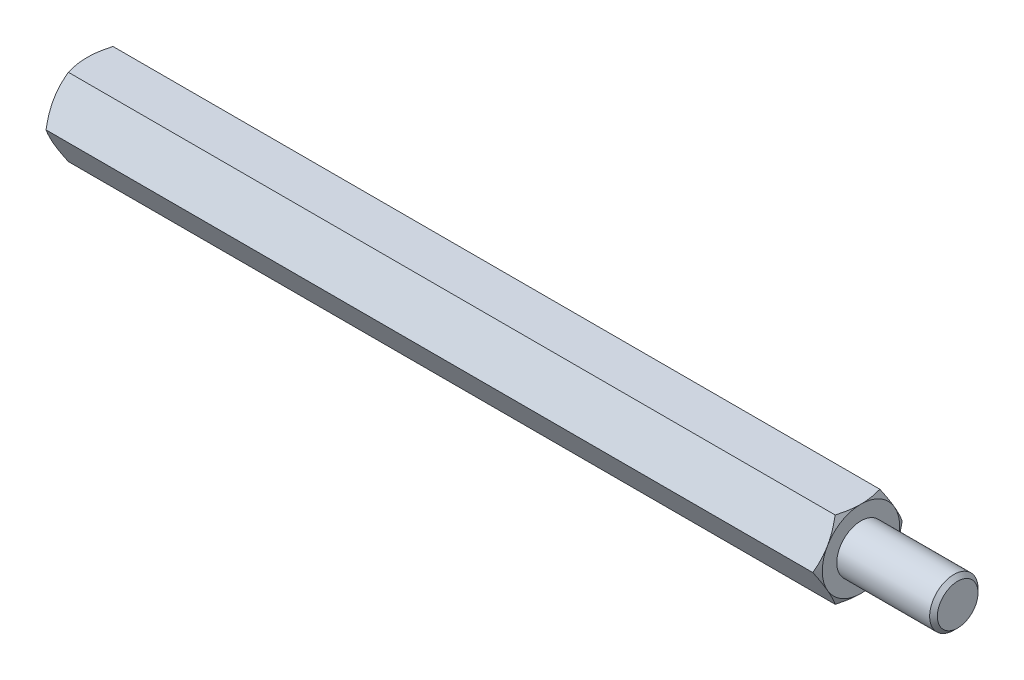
ISO-10303-21;
HEADER;
FILE_DESCRIPTION(('STEP AP214'),'2;1');
FILE_NAME('part.step','',(''),(''),'','','');
FILE_SCHEMA(('AUTOMOTIVE_DESIGN { 1 0 10303 214 1 1 1 1 }'));
ENDSEC;
DATA;
#1=APPLICATION_CONTEXT('core data for automotive mechanical design processes');
#2=APPLICATION_PROTOCOL_DEFINITION('international standard','automotive_design',2000,#1);
#3=PRODUCT_CONTEXT('',#1,'mechanical');
#4=PRODUCT('Part','Part','',(#3));
#5=PRODUCT_RELATED_PRODUCT_CATEGORY('part','',(#4));
#6=PRODUCT_DEFINITION_FORMATION('','',#4);
#7=PRODUCT_DEFINITION_CONTEXT('part definition',#1,'design');
#8=PRODUCT_DEFINITION('design','',#6,#7);
#9=PRODUCT_DEFINITION_SHAPE('','',#8);
#10=(LENGTH_UNIT() NAMED_UNIT(*) SI_UNIT(.MILLI.,.METRE.));
#11=(NAMED_UNIT(*) PLANE_ANGLE_UNIT() SI_UNIT($,.RADIAN.));
#12=(NAMED_UNIT(*) SI_UNIT($,.STERADIAN.) SOLID_ANGLE_UNIT());
#13=UNCERTAINTY_MEASURE_WITH_UNIT(LENGTH_MEASURE(1.E-05),#10,'distance_accuracy_value','');
#14=(GEOMETRIC_REPRESENTATION_CONTEXT(3) GLOBAL_UNCERTAINTY_ASSIGNED_CONTEXT((#13)) GLOBAL_UNIT_ASSIGNED_CONTEXT((#10,
#11,#12)) REPRESENTATION_CONTEXT('',''));
#15=CARTESIAN_POINT('',(0.,0.,0.));
#16=DIRECTION('',(0.,0.,1.));
#17=DIRECTION('',(1.,0.,0.));
#18=AXIS2_PLACEMENT_3D('',#15,#16,#17);
#19=CARTESIAN_POINT('',(40.,4.,-2.3094010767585));
#20=DIRECTION('',(1.,0.,0.));
#21=DIRECTION('',(0.,0.,-1.));
#22=AXIS2_PLACEMENT_3D('',#19,#20,#21);
#23=PLANE('',#22);
#24=CARTESIAN_POINT('',(40.,0.,0.));
#25=DIRECTION('',(1.,0.,0.));
#26=DIRECTION('',(0.,0.,-1.));
#27=AXIS2_PLACEMENT_3D('',#24,#25,#26);
#28=CIRCLE('',#27,4.00000000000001);
#29=CARTESIAN_POINT('',(40.,-2.00000000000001,-3.46410161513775));
#30=VERTEX_POINT('',#29);
#31=CARTESIAN_POINT('',(40.,1.99999999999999,-3.46410161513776));
#32=VERTEX_POINT('',#31);
#33=EDGE_CURVE('E288',#30,#32,#28,.T.);
#34=ORIENTED_EDGE('',*,*,#33,.T.);
#35=CARTESIAN_POINT('',(40.,4.,0.));
#36=VERTEX_POINT('',#35);
#37=EDGE_CURVE('E53',#32,#36,#28,.T.);
#38=ORIENTED_EDGE('',*,*,#37,.T.);
#39=CARTESIAN_POINT('',(40.,2.,3.46410161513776));
#40=VERTEX_POINT('',#39);
#41=EDGE_CURVE('E297',#36,#40,#28,.T.);
#42=ORIENTED_EDGE('',*,*,#41,.T.);
#43=CARTESIAN_POINT('',(40.,-2.00000000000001,3.46410161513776));
#44=VERTEX_POINT('',#43);
#45=EDGE_CURVE('E302',#40,#44,#28,.T.);
#46=ORIENTED_EDGE('',*,*,#45,.T.);
#47=CARTESIAN_POINT('',(40.,0.,0.));
#48=DIRECTION('',(-1.,0.,0.));
#49=DIRECTION('',(0.,-1.,0.));
#50=AXIS2_PLACEMENT_3D('',#47,#48,#49);
#51=CIRCLE('',#50,4.00000000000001);
#52=CARTESIAN_POINT('',(40.,-4.00000000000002,0.));
#53=VERTEX_POINT('',#52);
#54=EDGE_CURVE('E193',#53,#44,#51,.T.);
#55=ORIENTED_EDGE('',*,*,#54,.F.);
#56=EDGE_CURVE('E61',#53,#30,#28,.T.);
#57=ORIENTED_EDGE('',*,*,#56,.T.);
#58=EDGE_LOOP('',(#34,#38,#42,#46,#55,#57));
#59=FACE_BOUND('',#58,.T.);
#60=CARTESIAN_POINT('',(40.,0.,0.));
#61=DIRECTION('',(1.,0.,0.));
#62=DIRECTION('',(0.,0.,-1.));
#63=AXIS2_PLACEMENT_3D('',#60,#61,#62);
#64=CIRCLE('',#63,2.5);
#65=CARTESIAN_POINT('',(40.,0.,-2.5));
#66=VERTEX_POINT('',#65);
#67=EDGE_CURVE('E406',#66,#66,#64,.T.);
#68=ORIENTED_EDGE('',*,*,#67,.F.);
#69=EDGE_LOOP('',(#68));
#70=FACE_BOUND('',#69,.T.);
#71=ADVANCED_FACE('F37',(#59,#70),#23,.T.);
#72=CARTESIAN_POINT('',(40.,0.,-4.61880215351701));
#73=DIRECTION('',(0.,-0.5,0.866025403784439));
#74=DIRECTION('',(0.,-0.866025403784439,-0.5));
#75=AXIS2_PLACEMENT_3D('',#72,#73,#74);
#76=PLANE('',#75);
#77=CARTESIAN_POINT('',(39.6426677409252,-0.000200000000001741,-4.61891762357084));
#78=CARTESIAN_POINT('',(39.7012821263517,0.175579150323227,-4.5174314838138));
#79=CARTESIAN_POINT('',(39.7545896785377,0.35287561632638,-4.41506932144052));
#80=CARTESIAN_POINT('',(39.8476383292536,0.710538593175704,-4.20857250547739));
#81=CARTESIAN_POINT('',(39.8873465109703,0.890911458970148,-4.10443418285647));
#82=CARTESIAN_POINT('',(39.9491577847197,1.24942181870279,-3.89744813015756));
#83=CARTESIAN_POINT('',(39.9716722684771,1.42750415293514,-3.79463224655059));
#84=CARTESIAN_POINT('',(39.9985493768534,1.7845067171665,-3.58851671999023));
#85=CARTESIAN_POINT('',(40.0029342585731,1.9634256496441,-3.48521782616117));
#86=CARTESIAN_POINT('',(39.99380992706,2.29774284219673,-3.29219970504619));
#87=CARTESIAN_POINT('',(39.982541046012,2.45319115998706,-3.20245157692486));
#88=CARTESIAN_POINT('',(39.9468260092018,2.76307505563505,-3.02354002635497));
#89=CARTESIAN_POINT('',(39.9223676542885,2.91750956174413,-2.93437722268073));
#90=CARTESIAN_POINT('',(39.8612239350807,3.22803232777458,-2.75509682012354));
#91=CARTESIAN_POINT('',(39.8242793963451,3.3840812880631,-2.6650019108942));
#92=CARTESIAN_POINT('',(39.740429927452,3.69385183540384,-2.486155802));
#93=CARTESIAN_POINT('',(39.6935446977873,3.84757739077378,-2.39740231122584));
#94=CARTESIAN_POINT('',(39.6426677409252,4.0002,-2.30928560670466));
#95=B_SPLINE_CURVE_WITH_KNOTS('',3,(#77,#78,#79,#80,#81,#82,#83,#84,#85,#86,#87,#88,#89,#90,#91,
#92,#93,#94),.UNSPECIFIED.,.F.,.F.,(4,2,2,2,2,2,2,2,4),(0.,0.634047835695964,1.26961969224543,
1.88946157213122,2.50854226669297,3.04757825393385,3.58711366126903,4.13861653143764,
4.68903648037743),.UNSPECIFIED.);
#96=CARTESIAN_POINT('',(39.6427344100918,0.,-4.61880215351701));
#97=VERTEX_POINT('',#96);
#98=EDGE_CURVE('E376',#97,#32,#95,.T.);
#99=ORIENTED_EDGE('',*,*,#98,.F.);
#100=DIRECTION('',(-1.,0.,0.));
#101=VECTOR('',#100,1.);
#102=CARTESIAN_POINT('',(40.,0.,-4.61880215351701));
#103=LINE('',#102,#101);
#104=CARTESIAN_POINT('',(-39.6427344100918,0.,-4.61880215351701));
#105=VERTEX_POINT('',#104);
#106=EDGE_CURVE('E264',#97,#105,#103,.T.);
#107=ORIENTED_EDGE('',*,*,#106,.T.);
#108=CARTESIAN_POINT('',(-39.6426677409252,4.0002,-2.30928560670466));
#109=CARTESIAN_POINT('',(-39.7012821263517,3.82442084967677,-2.4107717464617));
#110=CARTESIAN_POINT('',(-39.7545896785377,3.64712438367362,-2.51313390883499));
#111=CARTESIAN_POINT('',(-39.8476383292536,3.28946140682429,-2.71963072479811));
#112=CARTESIAN_POINT('',(-39.8873465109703,3.10908854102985,-2.82376904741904));
#113=CARTESIAN_POINT('',(-39.9491577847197,2.75057818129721,-3.03075510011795));
#114=CARTESIAN_POINT('',(-39.9716722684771,2.57249584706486,-3.13357098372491));
#115=CARTESIAN_POINT('',(-39.9985493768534,2.21549328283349,-3.33968651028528));
#116=CARTESIAN_POINT('',(-40.0029342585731,2.0365743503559,-3.44298540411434));
#117=CARTESIAN_POINT('',(-39.99380992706,1.70225715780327,-3.63600352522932));
#118=CARTESIAN_POINT('',(-39.982541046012,1.54680884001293,-3.72575165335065));
#119=CARTESIAN_POINT('',(-39.9468260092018,1.23692494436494,-3.90466320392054));
#120=CARTESIAN_POINT('',(-39.9223676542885,1.08249043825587,-3.99382600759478));
#121=CARTESIAN_POINT('',(-39.8612239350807,0.771967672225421,-4.17310641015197));
#122=CARTESIAN_POINT('',(-39.8242793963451,0.615918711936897,-4.26320131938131));
#123=CARTESIAN_POINT('',(-39.740429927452,0.306148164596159,-4.4420474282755));
#124=CARTESIAN_POINT('',(-39.6935446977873,0.152422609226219,-4.53080091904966));
#125=CARTESIAN_POINT('',(-39.6426677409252,-0.000200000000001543,-4.61891762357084));
#126=B_SPLINE_CURVE_WITH_KNOTS('',3,(#108,#109,#110,#111,#112,#113,#114,#115,#116,#117,#118,
#119,#120,#121,#122,#123,#124,#125),.UNSPECIFIED.,.F.,.F.,(4,2,2,2,2,2,2,2,4),(0.,
0.634047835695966,1.26961969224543,1.88946157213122,2.50854226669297,3.04757825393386,
3.58711366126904,4.13861653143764,4.68903648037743),.UNSPECIFIED.);
#127=CARTESIAN_POINT('',(-40.,1.99999999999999,-3.46410161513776));
#128=VERTEX_POINT('',#127);
#129=EDGE_CURVE('E349',#128,#105,#126,.T.);
#130=ORIENTED_EDGE('',*,*,#129,.F.);
#131=CARTESIAN_POINT('',(-39.6427344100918,4.,-2.3094010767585));
#132=VERTEX_POINT('',#131);
#133=EDGE_CURVE('E338',#132,#128,#126,.T.);
#134=ORIENTED_EDGE('',*,*,#133,.F.);
#135=DIRECTION('',(-1.,0.,0.));
#136=VECTOR('',#135,1.);
#137=CARTESIAN_POINT('',(40.,4.,-2.3094010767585));
#138=LINE('',#137,#136);
#139=CARTESIAN_POINT('',(39.642734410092,4.,-2.30940107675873));
#140=VERTEX_POINT('',#139);
#141=EDGE_CURVE('E279',#140,#132,#138,.T.);
#142=ORIENTED_EDGE('',*,*,#141,.F.);
#143=EDGE_CURVE('E229',#32,#140,#95,.T.);
#144=ORIENTED_EDGE('',*,*,#143,.F.);
#145=EDGE_LOOP('',(#99,#107,#130,#134,#142,#144));
#146=FACE_BOUND('',#145,.T.);
#147=ADVANCED_FACE('F148',(#146),#76,.F.);
#148=CARTESIAN_POINT('',(40.,4.,-2.3094010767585));
#149=DIRECTION('',(0.,-1.,0.));
#150=DIRECTION('',(0.,0.,-1.));
#151=AXIS2_PLACEMENT_3D('',#148,#149,#150);
#152=PLANE('',#151);
#153=CARTESIAN_POINT('',(38.0082907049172,4.,-6.28479524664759));
#154=CARTESIAN_POINT('',(38.0937006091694,4.,-6.1093934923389));
#155=CARTESIAN_POINT('',(38.1783148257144,4.,-5.93359774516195));
#156=CARTESIAN_POINT('',(38.3455059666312,4.,-5.58100905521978));
#157=CARTESIAN_POINT('',(38.4280825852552,4.,-5.40421596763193));
#158=CARTESIAN_POINT('',(38.5911508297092,4.,-5.0485508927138));
#159=CARTESIAN_POINT('',(38.6716293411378,4.,-4.86967287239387));
#160=CARTESIAN_POINT('',(38.829400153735,4.,-4.51052237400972));
#161=CARTESIAN_POINT('',(38.906692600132,4.,-4.33024995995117));
#162=CARTESIAN_POINT('',(39.059802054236,4.,-3.9618911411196));
#163=CARTESIAN_POINT('',(39.135480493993,4.,-3.77374683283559));
#164=CARTESIAN_POINT('',(39.2813045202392,4.,-3.39528725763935));
#165=CARTESIAN_POINT('',(39.3514494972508,4.,-3.20497175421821));
#166=CARTESIAN_POINT('',(39.4844245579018,4.,-2.82219775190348));
#167=CARTESIAN_POINT('',(39.5472687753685,4.,-2.62974421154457));
#168=CARTESIAN_POINT('',(39.6636796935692,4.,-2.24207725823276));
#169=CARTESIAN_POINT('',(39.7172492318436,4.,-2.0468647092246));
#170=CARTESIAN_POINT('',(39.8123031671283,4.,-1.65467425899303));
#171=CARTESIAN_POINT('',(39.8538563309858,4.,-1.45771333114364));
#172=CARTESIAN_POINT('',(39.9225903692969,4.,-1.06125849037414));
#173=CARTESIAN_POINT('',(39.9497727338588,4.,-0.861764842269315));
#174=CARTESIAN_POINT('',(39.9872447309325,4.,-0.463879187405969));
#175=CARTESIAN_POINT('',(39.9977578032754,4.,-0.265508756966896));
#176=CARTESIAN_POINT('',(40.0015934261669,4.,0.131417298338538));
#177=CARTESIAN_POINT('',(39.9949158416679,4.,0.329972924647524));
#178=CARTESIAN_POINT('',(39.9696489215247,4.,0.664692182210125));
#179=CARTESIAN_POINT('',(39.9553708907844,4.,0.8012029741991));
#180=CARTESIAN_POINT('',(39.9195349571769,4.,1.07327201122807));
#181=CARTESIAN_POINT('',(39.8979761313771,4.,1.20883013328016));
#182=CARTESIAN_POINT('',(39.8235066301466,4.,1.61386939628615));
#183=CARTESIAN_POINT('',(39.7608149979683,4.,1.88157484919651));
#184=CARTESIAN_POINT('',(39.6515117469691,4.,2.28197262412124));
#185=CARTESIAN_POINT('',(39.612009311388,4.,2.41672443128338));
#186=CARTESIAN_POINT('',(39.5287523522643,4.,2.68492067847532));
#187=CARTESIAN_POINT('',(39.4849977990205,4.,2.81836510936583));
#188=CARTESIAN_POINT('',(39.3939510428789,4.,3.08398596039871));
#189=CARTESIAN_POINT('',(39.346659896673,4.,3.21616274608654));
#190=CARTESIAN_POINT('',(39.2491111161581,4.,3.47941134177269));
#191=CARTESIAN_POINT('',(39.1988535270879,4.,3.61048316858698));
#192=CARTESIAN_POINT('',(39.0713295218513,4.,3.93385125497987));
#193=CARTESIAN_POINT('',(38.9926014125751,4.,4.12557021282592));
#194=CARTESIAN_POINT('',(38.8309693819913,4.,4.50724553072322));
#195=CARTESIAN_POINT('',(38.7480651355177,4.,4.69720175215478));
#196=CARTESIAN_POINT('',(38.5789699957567,4.,5.07569950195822));
#197=CARTESIAN_POINT('',(38.4927782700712,4.,5.26424065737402));
#198=CARTESIAN_POINT('',(38.3178011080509,4.,5.64011758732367));
#199=CARTESIAN_POINT('',(38.2290156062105,4.,5.82745333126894));
#200=CARTESIAN_POINT('',(37.9593432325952,4.,6.38844423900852));
#201=CARTESIAN_POINT('',(37.7753561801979,4.,6.76060781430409));
#202=CARTESIAN_POINT('',(37.4019562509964,4.,7.50211228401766));
#203=CARTESIAN_POINT('',(37.2125442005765,4.,7.87145359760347));
#204=CARTESIAN_POINT('',(36.8473877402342,4.,8.57450173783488));
#205=CARTESIAN_POINT('',(36.671975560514,4.,8.90838144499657));
#206=CARTESIAN_POINT('',(36.3188097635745,4.,9.57491712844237));
#207=CARTESIAN_POINT('',(36.1410560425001,4.,9.90757304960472));
#208=CARTESIAN_POINT('',(35.7842933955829,4.,10.5709822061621));
#209=CARTESIAN_POINT('',(35.6052895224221,3.99999999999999,10.9017381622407));
#210=CARTESIAN_POINT('',(35.2459071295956,3.99999999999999,11.5624752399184));
#211=CARTESIAN_POINT('',(35.0655286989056,3.99999999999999,11.8924564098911));
#212=CARTESIAN_POINT('',(34.884642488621,3.99999999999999,12.2221569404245));
#213=B_SPLINE_CURVE_WITH_KNOTS('',3,(#153,#154,#155,#156,#157,#158,#159,#160,#161,#162,#163,
#164,#165,#166,#167,#168,#169,#170,#171,#172,#173,#174,#175,#176,#177,#178,#179,#180,#181,#182,
#183,#184,#185,#186,#187,#188,#189,#190,#191,#192,#193,#194,#195,#196,#197,#198,#199,#200,#201,
#202,#203,#204,#205,#206,#207,#208,#209,#210,#211,#212),.UNSPECIFIED.,.F.,.F.,(4,2,2,2,2,2,2,2,
2,2,2,2,2,2,2,2,2,2,2,2,2,2,2,2,2,2,2,2,2,4),(0.,0.585280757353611,1.17064881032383,
1.75906864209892,2.34746162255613,2.9557770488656,3.56415938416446,4.17134357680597,
4.77834167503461,5.38179402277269,5.98518378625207,6.5804150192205,7.17565092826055,
7.58721910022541,7.99883946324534,8.82250155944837,9.24373134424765,9.66496407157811,
10.086071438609,10.5071723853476,11.1288656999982,11.7506074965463,12.3725077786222,
12.9944237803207,14.2398211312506,15.4850297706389,16.6164791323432,17.7479788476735,
18.8762380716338,20.0044248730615),.UNSPECIFIED.);
#214=EDGE_CURVE('E227',#140,#36,#213,.T.);
#215=ORIENTED_EDGE('',*,*,#214,.F.);
#216=ORIENTED_EDGE('',*,*,#141,.T.);
#217=CARTESIAN_POINT('',(-38.0082907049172,4.,-6.28479524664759));
#218=CARTESIAN_POINT('',(-38.0937006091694,4.,-6.1093934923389));
#219=CARTESIAN_POINT('',(-38.1783148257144,4.,-5.93359774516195));
#220=CARTESIAN_POINT('',(-38.3455059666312,4.,-5.58100905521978));
#221=CARTESIAN_POINT('',(-38.4280825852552,4.,-5.40421596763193));
#222=CARTESIAN_POINT('',(-38.5911508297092,4.,-5.0485508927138));
#223=CARTESIAN_POINT('',(-38.6716293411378,4.,-4.86967287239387));
#224=CARTESIAN_POINT('',(-38.829400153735,4.,-4.51052237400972));
#225=CARTESIAN_POINT('',(-38.906692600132,4.,-4.33024995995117));
#226=CARTESIAN_POINT('',(-39.059802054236,4.,-3.9618911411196));
#227=CARTESIAN_POINT('',(-39.135480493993,4.,-3.77374683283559));
#228=CARTESIAN_POINT('',(-39.2813045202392,4.,-3.39528725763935));
#229=CARTESIAN_POINT('',(-39.3514494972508,4.,-3.20497175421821));
#230=CARTESIAN_POINT('',(-39.4844245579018,4.,-2.82219775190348));
#231=CARTESIAN_POINT('',(-39.5472687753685,4.,-2.62974421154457));
#232=CARTESIAN_POINT('',(-39.6636796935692,4.,-2.24207725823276));
#233=CARTESIAN_POINT('',(-39.7172492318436,4.,-2.0468647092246));
#234=CARTESIAN_POINT('',(-39.8123031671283,4.,-1.65467425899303));
#235=CARTESIAN_POINT('',(-39.8538563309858,4.,-1.45771333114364));
#236=CARTESIAN_POINT('',(-39.9225903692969,4.,-1.06125849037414));
#237=CARTESIAN_POINT('',(-39.9497727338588,4.,-0.861764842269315));
#238=CARTESIAN_POINT('',(-39.9872447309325,4.,-0.463879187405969));
#239=CARTESIAN_POINT('',(-39.9977578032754,4.,-0.265508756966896));
#240=CARTESIAN_POINT('',(-40.0015934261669,4.,0.131417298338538));
#241=CARTESIAN_POINT('',(-39.9949158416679,4.,0.329972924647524));
#242=CARTESIAN_POINT('',(-39.9696489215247,4.,0.664692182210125));
#243=CARTESIAN_POINT('',(-39.9553708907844,4.,0.8012029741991));
#244=CARTESIAN_POINT('',(-39.9195349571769,4.,1.07327201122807));
#245=CARTESIAN_POINT('',(-39.8979761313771,4.,1.20883013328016));
#246=CARTESIAN_POINT('',(-39.8235066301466,4.,1.61386939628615));
#247=CARTESIAN_POINT('',(-39.7608149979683,4.,1.88157484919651));
#248=CARTESIAN_POINT('',(-39.6515117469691,4.,2.28197262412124));
#249=CARTESIAN_POINT('',(-39.612009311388,4.,2.41672443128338));
#250=CARTESIAN_POINT('',(-39.5287523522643,4.,2.68492067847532));
#251=CARTESIAN_POINT('',(-39.4849977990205,4.,2.81836510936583));
#252=CARTESIAN_POINT('',(-39.3939510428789,4.,3.08398596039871));
#253=CARTESIAN_POINT('',(-39.346659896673,4.,3.21616274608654));
#254=CARTESIAN_POINT('',(-39.2491111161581,4.,3.47941134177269));
#255=CARTESIAN_POINT('',(-39.1988535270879,4.,3.61048316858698));
#256=CARTESIAN_POINT('',(-39.0713295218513,4.,3.93385125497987));
#257=CARTESIAN_POINT('',(-38.9926014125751,4.,4.12557021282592));
#258=CARTESIAN_POINT('',(-38.8309693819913,4.,4.50724553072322));
#259=CARTESIAN_POINT('',(-38.7480651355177,4.,4.69720175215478));
#260=CARTESIAN_POINT('',(-38.5789699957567,4.,5.07569950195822));
#261=CARTESIAN_POINT('',(-38.4927782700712,4.,5.26424065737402));
#262=CARTESIAN_POINT('',(-38.3178011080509,4.,5.64011758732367));
#263=CARTESIAN_POINT('',(-38.2290156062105,4.,5.82745333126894));
#264=CARTESIAN_POINT('',(-37.9593432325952,4.,6.38844423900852));
#265=CARTESIAN_POINT('',(-37.7753561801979,4.,6.76060781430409));
#266=CARTESIAN_POINT('',(-37.4019562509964,4.,7.50211228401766));
#267=CARTESIAN_POINT('',(-37.2125442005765,4.,7.87145359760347));
#268=CARTESIAN_POINT('',(-36.8473877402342,4.,8.57450173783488));
#269=CARTESIAN_POINT('',(-36.671975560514,4.,8.90838144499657));
#270=CARTESIAN_POINT('',(-36.3188097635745,4.,9.57491712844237));
#271=CARTESIAN_POINT('',(-36.1410560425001,4.,9.90757304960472));
#272=CARTESIAN_POINT('',(-35.7842933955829,4.,10.5709822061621));
#273=CARTESIAN_POINT('',(-35.6052895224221,3.99999999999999,10.9017381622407));
#274=CARTESIAN_POINT('',(-35.2459071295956,3.99999999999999,11.5624752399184));
#275=CARTESIAN_POINT('',(-35.0655286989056,3.99999999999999,11.8924564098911));
#276=CARTESIAN_POINT('',(-34.884642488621,3.99999999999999,12.2221569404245));
#277=B_SPLINE_CURVE_WITH_KNOTS('',3,(#217,#218,#219,#220,#221,#222,#223,#224,#225,#226,#227,
#228,#229,#230,#231,#232,#233,#234,#235,#236,#237,#238,#239,#240,#241,#242,#243,#244,#245,#246,
#247,#248,#249,#250,#251,#252,#253,#254,#255,#256,#257,#258,#259,#260,#261,#262,#263,#264,#265,
#266,#267,#268,#269,#270,#271,#272,#273,#274,#275,#276),.UNSPECIFIED.,.F.,.F.,(4,2,2,2,2,2,2,2,
2,2,2,2,2,2,2,2,2,2,2,2,2,2,2,2,2,2,2,2,2,4),(0.,0.585280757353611,1.17064881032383,
1.75906864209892,2.34746162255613,2.9557770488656,3.56415938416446,4.17134357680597,
4.77834167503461,5.38179402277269,5.98518378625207,6.5804150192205,7.17565092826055,
7.58721910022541,7.99883946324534,8.82250155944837,9.24373134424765,9.66496407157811,
10.086071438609,10.5071723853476,11.1288656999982,11.7506074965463,12.3725077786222,
12.9944237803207,14.2398211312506,15.4850297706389,16.6164791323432,17.7479788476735,
18.8762380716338,20.0044248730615),.UNSPECIFIED.);
#278=CARTESIAN_POINT('',(-40.,4.,0.));
#279=VERTEX_POINT('',#278);
#280=EDGE_CURVE('E241',#279,#132,#277,.F.);
#281=ORIENTED_EDGE('',*,*,#280,.F.);
#282=CARTESIAN_POINT('',(-39.6427344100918,4.,2.3094010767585));
#283=VERTEX_POINT('',#282);
#284=EDGE_CURVE('E249',#283,#279,#277,.F.);
#285=ORIENTED_EDGE('',*,*,#284,.F.);
#286=DIRECTION('',(-1.,0.,0.));
#287=VECTOR('',#286,1.);
#288=CARTESIAN_POINT('',(40.,4.,2.3094010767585));
#289=LINE('',#288,#287);
#290=CARTESIAN_POINT('',(39.6427344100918,4.,2.3094010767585));
#291=VERTEX_POINT('',#290);
#292=EDGE_CURVE('E276',#291,#283,#289,.T.);
#293=ORIENTED_EDGE('',*,*,#292,.F.);
#294=EDGE_CURVE('E221',#36,#291,#213,.T.);
#295=ORIENTED_EDGE('',*,*,#294,.F.);
#296=EDGE_LOOP('',(#215,#216,#281,#285,#293,#295));
#297=FACE_BOUND('',#296,.T.);
#298=ADVANCED_FACE('F153',(#297),#152,.F.);
#299=CARTESIAN_POINT('',(40.,4.,2.3094010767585));
#300=DIRECTION('',(0.,-0.5,-0.866025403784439));
#301=DIRECTION('',(0.,0.866025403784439,-0.5));
#302=AXIS2_PLACEMENT_3D('',#299,#300,#301);
#303=PLANE('',#302);
#304=CARTESIAN_POINT('',(39.6426677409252,4.0002,2.30928560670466));
#305=CARTESIAN_POINT('',(39.7012821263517,3.82442084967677,2.4107717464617));
#306=CARTESIAN_POINT('',(39.7545896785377,3.64712438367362,2.51313390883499));
#307=CARTESIAN_POINT('',(39.8476383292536,3.28946140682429,2.71963072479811));
#308=CARTESIAN_POINT('',(39.8873465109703,3.10908854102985,2.82376904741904));
#309=CARTESIAN_POINT('',(39.9491577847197,2.75057818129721,3.03075510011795));
#310=CARTESIAN_POINT('',(39.9716722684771,2.57249584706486,3.13357098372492));
#311=CARTESIAN_POINT('',(39.9985493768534,2.21549328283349,3.33968651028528));
#312=CARTESIAN_POINT('',(40.0029342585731,2.0365743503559,3.44298540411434));
#313=CARTESIAN_POINT('',(39.99380992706,1.70225715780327,3.63600352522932));
#314=CARTESIAN_POINT('',(39.982541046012,1.54680884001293,3.72575165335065));
#315=CARTESIAN_POINT('',(39.9468260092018,1.23692494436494,3.90466320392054));
#316=CARTESIAN_POINT('',(39.9223676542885,1.08249043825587,3.99382600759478));
#317=CARTESIAN_POINT('',(39.8612239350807,0.771967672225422,4.17310641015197));
#318=CARTESIAN_POINT('',(39.8242793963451,0.615918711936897,4.26320131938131));
#319=CARTESIAN_POINT('',(39.740429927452,0.30614816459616,4.4420474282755));
#320=CARTESIAN_POINT('',(39.6935446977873,0.152422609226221,4.53080091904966));
#321=CARTESIAN_POINT('',(39.6426677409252,-0.000199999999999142,4.61891762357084));
#322=B_SPLINE_CURVE_WITH_KNOTS('',3,(#304,#305,#306,#307,#308,#309,#310,#311,#312,#313,#314,
#315,#316,#317,#318,#319,#320,#321),.UNSPECIFIED.,.F.,.F.,(4,2,2,2,2,2,2,2,4),(0.,
0.634047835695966,1.26961969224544,1.88946157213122,2.50854226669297,3.04757825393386,
3.58711366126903,4.13861653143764,4.68903648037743),.UNSPECIFIED.);
#323=EDGE_CURVE('E228',#291,#40,#322,.T.);
#324=ORIENTED_EDGE('',*,*,#323,.F.);
#325=ORIENTED_EDGE('',*,*,#292,.T.);
#326=CARTESIAN_POINT('',(-39.6426677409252,-0.000199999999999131,4.61891762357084));
#327=CARTESIAN_POINT('',(-39.7012821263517,0.17557915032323,4.5174314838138));
#328=CARTESIAN_POINT('',(-39.7545896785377,0.352875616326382,4.41506932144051));
#329=CARTESIAN_POINT('',(-39.8476383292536,0.710538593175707,4.20857250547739));
#330=CARTESIAN_POINT('',(-39.8873465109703,0.890911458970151,4.10443418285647));
#331=CARTESIAN_POINT('',(-39.9491577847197,1.24942181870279,3.89744813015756));
#332=CARTESIAN_POINT('',(-39.9716722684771,1.42750415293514,3.79463224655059));
#333=CARTESIAN_POINT('',(-39.9985493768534,1.78450671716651,3.58851671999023));
#334=CARTESIAN_POINT('',(-40.0029342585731,1.9634256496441,3.48521782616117));
#335=CARTESIAN_POINT('',(-39.99380992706,2.29774284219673,3.29219970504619));
#336=CARTESIAN_POINT('',(-39.982541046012,2.45319115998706,3.20245157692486));
#337=CARTESIAN_POINT('',(-39.9468260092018,2.76307505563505,3.02354002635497));
#338=CARTESIAN_POINT('',(-39.9223676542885,2.91750956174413,2.93437722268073));
#339=CARTESIAN_POINT('',(-39.8612239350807,3.22803232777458,2.75509682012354));
#340=CARTESIAN_POINT('',(-39.8242793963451,3.3840812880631,2.6650019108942));
#341=CARTESIAN_POINT('',(-39.740429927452,3.69385183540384,2.48615580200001));
#342=CARTESIAN_POINT('',(-39.6935446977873,3.84757739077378,2.39740231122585));
#343=CARTESIAN_POINT('',(-39.6426677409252,4.0002,2.30928560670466));
#344=B_SPLINE_CURVE_WITH_KNOTS('',3,(#326,#327,#328,#329,#330,#331,#332,#333,#334,#335,#336,
#337,#338,#339,#340,#341,#342,#343),.UNSPECIFIED.,.F.,.F.,(4,2,2,2,2,2,2,2,4),(0.,
0.634047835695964,1.26961969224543,1.88946157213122,2.50854226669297,3.04757825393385,
3.58711366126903,4.13861653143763,4.68903648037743),.UNSPECIFIED.);
#345=CARTESIAN_POINT('',(-40.,2.,3.46410161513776));
#346=VERTEX_POINT('',#345);
#347=EDGE_CURVE('E255',#346,#283,#344,.T.);
#348=ORIENTED_EDGE('',*,*,#347,.F.);
#349=CARTESIAN_POINT('',(-39.6427344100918,0.,4.618802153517));
#350=VERTEX_POINT('',#349);
#351=EDGE_CURVE('E262',#350,#346,#344,.T.);
#352=ORIENTED_EDGE('',*,*,#351,.F.);
#353=DIRECTION('',(-1.,0.,0.));
#354=VECTOR('',#353,1.);
#355=CARTESIAN_POINT('',(40.,0.,4.618802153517));
#356=LINE('',#355,#354);
#357=CARTESIAN_POINT('',(39.6427344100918,0.,4.618802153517));
#358=VERTEX_POINT('',#357);
#359=EDGE_CURVE('E273',#358,#350,#356,.T.);
#360=ORIENTED_EDGE('',*,*,#359,.F.);
#361=EDGE_CURVE('E215',#40,#358,#322,.T.);
#362=ORIENTED_EDGE('',*,*,#361,.F.);
#363=EDGE_LOOP('',(#324,#325,#348,#352,#360,#362));
#364=FACE_BOUND('',#363,.T.);
#365=ADVANCED_FACE('F235',(#364),#303,.F.);
#366=CARTESIAN_POINT('',(40.,0.,4.618802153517));
#367=DIRECTION('',(0.,0.5,-0.866025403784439));
#368=DIRECTION('',(0.,0.866025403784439,0.5));
#369=AXIS2_PLACEMENT_3D('',#366,#367,#368);
#370=PLANE('',#369);
#371=CARTESIAN_POINT('',(39.6426677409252,0.000200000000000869,4.61891762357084));
#372=CARTESIAN_POINT('',(39.7012821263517,-0.175579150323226,4.5174314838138));
#373=CARTESIAN_POINT('',(39.7545896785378,-0.352875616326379,4.41506932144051));
#374=CARTESIAN_POINT('',(39.8476383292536,-0.710538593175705,4.20857250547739));
#375=CARTESIAN_POINT('',(39.8873465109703,-0.890911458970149,4.10443418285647));
#376=CARTESIAN_POINT('',(39.9491577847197,-1.24942181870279,3.89744813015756));
#377=CARTESIAN_POINT('',(39.9716722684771,-1.42750415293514,3.79463224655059));
#378=CARTESIAN_POINT('',(39.9985493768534,-1.78450671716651,3.58851671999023));
#379=CARTESIAN_POINT('',(40.0029342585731,-1.9634256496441,3.48521782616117));
#380=CARTESIAN_POINT('',(39.99380992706,-2.29774284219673,3.29219970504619));
#381=CARTESIAN_POINT('',(39.982541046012,-2.45319115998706,3.20245157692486));
#382=CARTESIAN_POINT('',(39.9468260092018,-2.76307505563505,3.02354002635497));
#383=CARTESIAN_POINT('',(39.9223676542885,-2.91750956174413,2.93437722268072));
#384=CARTESIAN_POINT('',(39.8612239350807,-3.22803232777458,2.75509682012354));
#385=CARTESIAN_POINT('',(39.8242793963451,-3.3840812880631,2.6650019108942));
#386=CARTESIAN_POINT('',(39.740429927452,-3.69385183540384,2.48615580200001));
#387=CARTESIAN_POINT('',(39.6935446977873,-3.84757739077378,2.39740231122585));
#388=CARTESIAN_POINT('',(39.6426677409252,-4.0002,2.30928560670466));
#389=B_SPLINE_CURVE_WITH_KNOTS('',3,(#371,#372,#373,#374,#375,#376,#377,#378,#379,#380,#381,
#382,#383,#384,#385,#386,#387,#388),.UNSPECIFIED.,.F.,.F.,(4,2,2,2,2,2,2,2,4),(0.,
0.634047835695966,1.26961969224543,1.88946157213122,2.50854226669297,3.04757825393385,
3.58711366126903,4.13861653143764,4.68903648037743),.UNSPECIFIED.);
#390=EDGE_CURVE('E389',#358,#44,#389,.T.);
#391=ORIENTED_EDGE('',*,*,#390,.F.);
#392=ORIENTED_EDGE('',*,*,#359,.T.);
#393=CARTESIAN_POINT('',(-39.6426677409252,-4.0002,2.30928560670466));
#394=CARTESIAN_POINT('',(-39.7012821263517,-3.82442084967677,2.4107717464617));
#395=CARTESIAN_POINT('',(-39.7545896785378,-3.64712438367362,2.51313390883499));
#396=CARTESIAN_POINT('',(-39.8476383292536,-3.2894614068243,2.71963072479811));
#397=CARTESIAN_POINT('',(-39.8873465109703,-3.10908854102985,2.82376904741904));
#398=CARTESIAN_POINT('',(-39.9491577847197,-2.75057818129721,3.03075510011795));
#399=CARTESIAN_POINT('',(-39.9716722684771,-2.57249584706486,3.13357098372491));
#400=CARTESIAN_POINT('',(-39.9985493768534,-2.2154932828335,3.33968651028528));
#401=CARTESIAN_POINT('',(-40.0029342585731,-2.03657435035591,3.44298540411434));
#402=CARTESIAN_POINT('',(-39.99380992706,-1.70225715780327,3.63600352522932));
#403=CARTESIAN_POINT('',(-39.982541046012,-1.54680884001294,3.72575165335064));
#404=CARTESIAN_POINT('',(-39.9468260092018,-1.23692494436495,3.90466320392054));
#405=CARTESIAN_POINT('',(-39.9223676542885,-1.08249043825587,3.99382600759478));
#406=CARTESIAN_POINT('',(-39.8612239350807,-0.771967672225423,4.17310641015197));
#407=CARTESIAN_POINT('',(-39.8242793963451,-0.615918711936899,4.26320131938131));
#408=CARTESIAN_POINT('',(-39.740429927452,-0.306148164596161,4.4420474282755));
#409=CARTESIAN_POINT('',(-39.6935446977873,-0.152422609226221,4.53080091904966));
#410=CARTESIAN_POINT('',(-39.6426677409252,0.000200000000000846,4.61891762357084));
#411=B_SPLINE_CURVE_WITH_KNOTS('',3,(#393,#394,#395,#396,#397,#398,#399,#400,#401,#402,#403,
#404,#405,#406,#407,#408,#409,#410),.UNSPECIFIED.,.F.,.F.,(4,2,2,2,2,2,2,2,4),(0.,
0.634047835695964,1.26961969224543,1.88946157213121,2.50854226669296,3.04757825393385,
3.58711366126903,4.13861653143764,4.68903648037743),.UNSPECIFIED.);
#412=CARTESIAN_POINT('',(-40.,-2.00000000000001,3.46410161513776));
#413=VERTEX_POINT('',#412);
#414=EDGE_CURVE('E263',#413,#350,#411,.T.);
#415=ORIENTED_EDGE('',*,*,#414,.F.);
#416=CARTESIAN_POINT('',(-39.6427344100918,-4.,2.3094010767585));
#417=VERTEX_POINT('',#416);
#418=EDGE_CURVE('E250',#417,#413,#411,.T.);
#419=ORIENTED_EDGE('',*,*,#418,.F.);
#420=DIRECTION('',(-1.,0.,0.));
#421=VECTOR('',#420,1.);
#422=CARTESIAN_POINT('',(40.,-4.,2.3094010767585));
#423=LINE('',#422,#421);
#424=CARTESIAN_POINT('',(39.6427344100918,-4.,2.3094010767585));
#425=VERTEX_POINT('',#424);
#426=EDGE_CURVE('E270',#425,#417,#423,.T.);
#427=ORIENTED_EDGE('',*,*,#426,.F.);
#428=EDGE_CURVE('E210',#44,#425,#389,.T.);
#429=ORIENTED_EDGE('',*,*,#428,.F.);
#430=EDGE_LOOP('',(#391,#392,#415,#419,#427,#429));
#431=FACE_BOUND('',#430,.T.);
#432=ADVANCED_FACE('F425',(#431),#370,.F.);
#433=CARTESIAN_POINT('',(40.,-4.,2.3094010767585));
#434=DIRECTION('',(0.,1.,0.));
#435=DIRECTION('',(0.,0.,1.));
#436=AXIS2_PLACEMENT_3D('',#433,#434,#435);
#437=PLANE('',#436);
#438=CARTESIAN_POINT('',(38.0082907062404,-4.,-6.28479524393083));
#439=CARTESIAN_POINT('',(38.0937006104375,-4.,-6.10939348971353));
#440=CARTESIAN_POINT('',(38.1783148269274,-4.,-5.93359774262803));
#441=CARTESIAN_POINT('',(38.3455059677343,-4.,-5.58100905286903));
#442=CARTESIAN_POINT('',(38.4280825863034,-4.,-5.40421596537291));
#443=CARTESIAN_POINT('',(38.5911508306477,-4.,-5.04855089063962));
#444=CARTESIAN_POINT('',(38.6716293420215,-4.,-4.86967287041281));
#445=CARTESIAN_POINT('',(38.8294001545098,-4.,-4.51052237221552));
#446=CARTESIAN_POINT('',(38.9066926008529,-4.,-4.33024995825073));
#447=CARTESIAN_POINT('',(39.0598020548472,-4.,-3.96189113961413));
#448=CARTESIAN_POINT('',(39.1354804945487,-4.,-3.77374683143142));
#449=CARTESIAN_POINT('',(39.2813045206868,-4.,-3.39528725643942));
#450=CARTESIAN_POINT('',(39.3514494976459,-4.,-3.2049717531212));
#451=CARTESIAN_POINT('',(39.4844245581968,-4.,-2.82219775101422));
#452=CARTESIAN_POINT('',(39.5472687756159,-4.,-2.62974421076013));
#453=CARTESIAN_POINT('',(39.6636796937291,-4.,-2.24207725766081));
#454=CARTESIAN_POINT('',(39.7172492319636,-4.,-2.04686470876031));
#455=CARTESIAN_POINT('',(39.8123031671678,-4.,-1.65467425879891));
#456=CARTESIAN_POINT('',(39.8538563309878,-4.,-1.45771333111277));
#457=CARTESIAN_POINT('',(39.9225903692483,-4.,-1.06125849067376));
#458=CARTESIAN_POINT('',(39.9497727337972,-4.,-0.86176484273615));
#459=CARTESIAN_POINT('',(39.9872447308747,-4.,-0.463879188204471));
#460=CARTESIAN_POINT('',(39.9977578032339,-4.,-0.265508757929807));
#461=CARTESIAN_POINT('',(40.0015934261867,-4.,0.131417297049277));
#462=CARTESIAN_POINT('',(39.9949158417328,-4.,0.329972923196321));
#463=CARTESIAN_POINT('',(39.9696489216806,-4.,0.664692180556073));
#464=CARTESIAN_POINT('',(39.9553708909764,-4.,0.801202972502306));
#465=CARTESIAN_POINT('',(39.9195349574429,-4.,1.07327200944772));
#466=CARTESIAN_POINT('',(39.8979761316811,-4.,1.20883013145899));
#467=CARTESIAN_POINT('',(39.8235066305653,-4.,1.6138693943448));
#468=CARTESIAN_POINT('',(39.7608149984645,-4.,1.88157484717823));
#469=CARTESIAN_POINT('',(39.6515117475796,-4.,2.28197262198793));
#470=CARTESIAN_POINT('',(39.6120093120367,-4.,2.41672442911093));
#471=CARTESIAN_POINT('',(39.5287523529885,-4.,2.68492067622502));
#472=CARTESIAN_POINT('',(39.4849977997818,-4.,2.81836510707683));
#473=CARTESIAN_POINT('',(39.3939510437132,-4.,3.0839859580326));
#474=CARTESIAN_POINT('',(39.3466598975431,-4.,3.21616274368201));
#475=CARTESIAN_POINT('',(39.2491111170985,-4.,3.47941133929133));
#476=CARTESIAN_POINT('',(39.1988535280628,-4.,3.61048316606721));
#477=CARTESIAN_POINT('',(39.0713295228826,-4.,3.93385125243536));
#478=CARTESIAN_POINT('',(38.9926014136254,-4.,4.12557021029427));
#479=CARTESIAN_POINT('',(38.830969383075,-4.,4.50724552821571));
#480=CARTESIAN_POINT('',(38.7480651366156,-4.,4.69720174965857));
#481=CARTESIAN_POINT('',(38.5789699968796,-4.,5.07569949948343));
#482=CARTESIAN_POINT('',(38.4927782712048,-4.,5.26424065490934));
#483=CARTESIAN_POINT('',(38.3178011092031,-4.,5.64011758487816));
#484=CARTESIAN_POINT('',(38.2290156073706,-4.,5.82745332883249));
#485=CARTESIAN_POINT('',(37.9593432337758,-4.,6.38844423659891));
#486=CARTESIAN_POINT('',(37.775356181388,-4.,6.76060781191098));
#487=CARTESIAN_POINT('',(37.4019562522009,-4.,7.50211228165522));
#488=CARTESIAN_POINT('',(37.2125442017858,-4.,7.87145359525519));
#489=CARTESIAN_POINT('',(36.8473877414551,-4.,8.57450173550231));
#490=CARTESIAN_POINT('',(36.671975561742,-4.,8.90838144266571));
#491=CARTESIAN_POINT('',(36.3188097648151,-4.,9.5749171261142));
#492=CARTESIAN_POINT('',(36.1410560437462,-4.,9.90757304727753));
#493=CARTESIAN_POINT('',(35.78429339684,-4.,10.5709822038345));
#494=CARTESIAN_POINT('',(35.6052895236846,-4.,10.9017381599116));
#495=CARTESIAN_POINT('',(35.2459071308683,-4.,11.562475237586));
#496=CARTESIAN_POINT('',(35.065528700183,-4.,11.8924564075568));
#497=CARTESIAN_POINT('',(34.884642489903,-4.,12.2221569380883));
#498=B_SPLINE_CURVE_WITH_KNOTS('',3,(#438,#439,#440,#441,#442,#443,#444,#445,#446,#447,#448,
#449,#450,#451,#452,#453,#454,#455,#456,#457,#458,#459,#460,#461,#462,#463,#464,#465,#466,#467,
#468,#469,#470,#471,#472,#473,#474,#475,#476,#477,#478,#479,#480,#481,#482,#483,#484,#485,#486,
#487,#488,#489,#490,#491,#492,#493,#494,#495,#496,#497),.UNSPECIFIED.,.F.,.F.,(4,2,2,2,2,2,2,2,
2,2,2,2,2,2,2,2,2,2,2,2,2,2,2,2,2,2,2,2,2,4),(0.,0.585280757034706,1.17064880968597,
1.75906864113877,2.34746162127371,2.95577704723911,3.56415938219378,4.17134357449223,
4.77834167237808,5.38179401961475,5.98518378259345,6.58041501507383,7.17565092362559,
7.58721909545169,7.99883945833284,8.82250155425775,9.24373133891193,9.6649640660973,
10.0860714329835,10.5071723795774,11.1288656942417,11.7506074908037,12.3725077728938,
12.9944237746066,14.2398211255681,15.4850297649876,16.6164791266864,17.7479788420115,
18.8762380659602,20.0044248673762),.UNSPECIFIED.);
#499=EDGE_CURVE('E396',#425,#53,#498,.F.);
#500=ORIENTED_EDGE('',*,*,#499,.F.);
#501=ORIENTED_EDGE('',*,*,#426,.T.);
#502=CARTESIAN_POINT('',(-38.0082907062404,-4.,-6.28479524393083));
#503=CARTESIAN_POINT('',(-38.0937006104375,-4.,-6.10939348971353));
#504=CARTESIAN_POINT('',(-38.1783148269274,-4.,-5.93359774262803));
#505=CARTESIAN_POINT('',(-38.3455059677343,-4.,-5.58100905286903));
#506=CARTESIAN_POINT('',(-38.4280825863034,-4.,-5.40421596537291));
#507=CARTESIAN_POINT('',(-38.5911508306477,-4.,-5.04855089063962));
#508=CARTESIAN_POINT('',(-38.6716293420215,-4.,-4.86967287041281));
#509=CARTESIAN_POINT('',(-38.8294001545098,-4.,-4.51052237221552));
#510=CARTESIAN_POINT('',(-38.9066926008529,-4.,-4.33024995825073));
#511=CARTESIAN_POINT('',(-39.0598020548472,-4.,-3.96189113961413));
#512=CARTESIAN_POINT('',(-39.1354804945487,-4.,-3.77374683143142));
#513=CARTESIAN_POINT('',(-39.2813045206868,-4.,-3.39528725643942));
#514=CARTESIAN_POINT('',(-39.3514494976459,-4.,-3.2049717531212));
#515=CARTESIAN_POINT('',(-39.4844245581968,-4.,-2.82219775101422));
#516=CARTESIAN_POINT('',(-39.5472687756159,-4.,-2.62974421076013));
#517=CARTESIAN_POINT('',(-39.6636796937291,-4.,-2.24207725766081));
#518=CARTESIAN_POINT('',(-39.7172492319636,-4.,-2.04686470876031));
#519=CARTESIAN_POINT('',(-39.8123031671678,-4.,-1.65467425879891));
#520=CARTESIAN_POINT('',(-39.8538563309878,-4.,-1.45771333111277));
#521=CARTESIAN_POINT('',(-39.9225903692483,-4.,-1.06125849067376));
#522=CARTESIAN_POINT('',(-39.9497727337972,-4.,-0.86176484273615));
#523=CARTESIAN_POINT('',(-39.9872447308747,-4.,-0.463879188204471));
#524=CARTESIAN_POINT('',(-39.9977578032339,-4.,-0.265508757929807));
#525=CARTESIAN_POINT('',(-40.0015934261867,-4.,0.131417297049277));
#526=CARTESIAN_POINT('',(-39.9949158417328,-4.,0.329972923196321));
#527=CARTESIAN_POINT('',(-39.9696489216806,-4.,0.664692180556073));
#528=CARTESIAN_POINT('',(-39.9553708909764,-4.,0.801202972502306));
#529=CARTESIAN_POINT('',(-39.9195349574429,-4.,1.07327200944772));
#530=CARTESIAN_POINT('',(-39.8979761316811,-4.,1.20883013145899));
#531=CARTESIAN_POINT('',(-39.8235066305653,-4.,1.6138693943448));
#532=CARTESIAN_POINT('',(-39.7608149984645,-4.,1.88157484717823));
#533=CARTESIAN_POINT('',(-39.6515117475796,-4.,2.28197262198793));
#534=CARTESIAN_POINT('',(-39.6120093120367,-4.,2.41672442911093));
#535=CARTESIAN_POINT('',(-39.5287523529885,-4.,2.68492067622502));
#536=CARTESIAN_POINT('',(-39.4849977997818,-4.,2.81836510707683));
#537=CARTESIAN_POINT('',(-39.3939510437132,-4.,3.0839859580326));
#538=CARTESIAN_POINT('',(-39.3466598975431,-4.,3.21616274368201));
#539=CARTESIAN_POINT('',(-39.2491111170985,-4.,3.47941133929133));
#540=CARTESIAN_POINT('',(-39.1988535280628,-4.,3.61048316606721));
#541=CARTESIAN_POINT('',(-39.0713295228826,-4.,3.93385125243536));
#542=CARTESIAN_POINT('',(-38.9926014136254,-4.,4.12557021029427));
#543=CARTESIAN_POINT('',(-38.830969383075,-4.,4.50724552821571));
#544=CARTESIAN_POINT('',(-38.7480651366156,-4.,4.69720174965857));
#545=CARTESIAN_POINT('',(-38.5789699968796,-4.,5.07569949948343));
#546=CARTESIAN_POINT('',(-38.4927782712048,-4.,5.26424065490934));
#547=CARTESIAN_POINT('',(-38.3178011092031,-4.,5.64011758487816));
#548=CARTESIAN_POINT('',(-38.2290156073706,-4.,5.82745332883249));
#549=CARTESIAN_POINT('',(-37.9593432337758,-4.,6.38844423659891));
#550=CARTESIAN_POINT('',(-37.775356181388,-4.,6.76060781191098));
#551=CARTESIAN_POINT('',(-37.4019562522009,-4.,7.50211228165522));
#552=CARTESIAN_POINT('',(-37.2125442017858,-4.,7.87145359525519));
#553=CARTESIAN_POINT('',(-36.8473877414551,-4.,8.57450173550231));
#554=CARTESIAN_POINT('',(-36.671975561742,-4.,8.90838144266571));
#555=CARTESIAN_POINT('',(-36.3188097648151,-4.,9.5749171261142));
#556=CARTESIAN_POINT('',(-36.1410560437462,-4.,9.90757304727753));
#557=CARTESIAN_POINT('',(-35.78429339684,-4.,10.5709822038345));
#558=CARTESIAN_POINT('',(-35.6052895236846,-4.,10.9017381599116));
#559=CARTESIAN_POINT('',(-35.2459071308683,-4.,11.562475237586));
#560=CARTESIAN_POINT('',(-35.065528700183,-4.,11.8924564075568));
#561=CARTESIAN_POINT('',(-34.884642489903,-4.,12.2221569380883));
#562=B_SPLINE_CURVE_WITH_KNOTS('',3,(#502,#503,#504,#505,#506,#507,#508,#509,#510,#511,#512,
#513,#514,#515,#516,#517,#518,#519,#520,#521,#522,#523,#524,#525,#526,#527,#528,#529,#530,#531,
#532,#533,#534,#535,#536,#537,#538,#539,#540,#541,#542,#543,#544,#545,#546,#547,#548,#549,#550,
#551,#552,#553,#554,#555,#556,#557,#558,#559,#560,#561),.UNSPECIFIED.,.F.,.F.,(4,2,2,2,2,2,2,2,
2,2,2,2,2,2,2,2,2,2,2,2,2,2,2,2,2,2,2,2,2,4),(0.,0.585280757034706,1.17064880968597,
1.75906864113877,2.34746162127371,2.95577704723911,3.56415938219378,4.17134357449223,
4.77834167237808,5.38179401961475,5.98518378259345,6.58041501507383,7.17565092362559,
7.58721909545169,7.99883945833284,8.82250155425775,9.24373133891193,9.6649640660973,
10.0860714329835,10.5071723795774,11.1288656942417,11.7506074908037,12.3725077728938,
12.9944237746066,14.2398211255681,15.4850297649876,16.6164791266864,17.7479788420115,
18.8762380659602,20.0044248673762),.UNSPECIFIED.);
#563=CARTESIAN_POINT('',(-40.,-4.00000000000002,0.));
#564=VERTEX_POINT('',#563);
#565=EDGE_CURVE('E351',#564,#417,#562,.T.);
#566=ORIENTED_EDGE('',*,*,#565,.F.);
#567=CARTESIAN_POINT('',(-39.6427344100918,-4.,-2.3094010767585));
#568=VERTEX_POINT('',#567);
#569=EDGE_CURVE('E354',#568,#564,#562,.T.);
#570=ORIENTED_EDGE('',*,*,#569,.F.);
#571=DIRECTION('',(-1.,0.,0.));
#572=VECTOR('',#571,1.);
#573=CARTESIAN_POINT('',(40.,-4.,-2.3094010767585));
#574=LINE('',#573,#572);
#575=CARTESIAN_POINT('',(39.6427344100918,-4.,-2.3094010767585));
#576=VERTEX_POINT('',#575);
#577=EDGE_CURVE('E267',#576,#568,#574,.T.);
#578=ORIENTED_EDGE('',*,*,#577,.F.);
#579=EDGE_CURVE('E195',#53,#576,#498,.F.);
#580=ORIENTED_EDGE('',*,*,#579,.F.);
#581=EDGE_LOOP('',(#500,#501,#566,#570,#578,#580));
#582=FACE_BOUND('',#581,.T.);
#583=ADVANCED_FACE('F172',(#582),#437,.F.);
#584=CARTESIAN_POINT('',(40.,-4.,-2.3094010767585));
#585=DIRECTION('',(0.,0.5,0.866025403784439));
#586=DIRECTION('',(0.,-0.866025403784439,0.5));
#587=AXIS2_PLACEMENT_3D('',#584,#585,#586);
#588=PLANE('',#587);
#589=CARTESIAN_POINT('',(39.6426677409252,-4.0002,-2.30928560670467));
#590=CARTESIAN_POINT('',(39.7012821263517,-3.82442084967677,-2.4107717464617));
#591=CARTESIAN_POINT('',(39.7545896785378,-3.64712438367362,-2.51313390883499));
#592=CARTESIAN_POINT('',(39.8476383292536,-3.28946140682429,-2.71963072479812));
#593=CARTESIAN_POINT('',(39.8873465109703,-3.10908854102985,-2.82376904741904));
#594=CARTESIAN_POINT('',(39.9491577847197,-2.75057818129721,-3.03075510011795));
#595=CARTESIAN_POINT('',(39.9716722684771,-2.57249584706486,-3.13357098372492));
#596=CARTESIAN_POINT('',(39.9985493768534,-2.21549328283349,-3.33968651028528));
#597=CARTESIAN_POINT('',(40.0029342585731,-2.0365743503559,-3.44298540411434));
#598=CARTESIAN_POINT('',(39.99380992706,-1.70225715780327,-3.63600352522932));
#599=CARTESIAN_POINT('',(39.982541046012,-1.54680884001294,-3.72575165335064));
#600=CARTESIAN_POINT('',(39.9468260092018,-1.23692494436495,-3.90466320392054));
#601=CARTESIAN_POINT('',(39.9223676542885,-1.08249043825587,-3.99382600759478));
#602=CARTESIAN_POINT('',(39.8612239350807,-0.771967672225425,-4.17310641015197));
#603=CARTESIAN_POINT('',(39.8242793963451,-0.615918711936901,-4.26320131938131));
#604=CARTESIAN_POINT('',(39.740429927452,-0.306148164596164,-4.4420474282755));
#605=CARTESIAN_POINT('',(39.6935446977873,-0.152422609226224,-4.53080091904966));
#606=CARTESIAN_POINT('',(39.6426677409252,0.000199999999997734,-4.61891762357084));
#607=B_SPLINE_CURVE_WITH_KNOTS('',3,(#589,#590,#591,#592,#593,#594,#595,#596,#597,#598,#599,
#600,#601,#602,#603,#604,#605,#606),.UNSPECIFIED.,.F.,.F.,(4,2,2,2,2,2,2,2,4),(0.,
0.634047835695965,1.26961969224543,1.88946157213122,2.50854226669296,3.04757825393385,
3.58711366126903,4.13861653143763,4.68903648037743),.UNSPECIFIED.);
#608=EDGE_CURVE('E192',#576,#30,#607,.T.);
#609=ORIENTED_EDGE('',*,*,#608,.F.);
#610=ORIENTED_EDGE('',*,*,#577,.T.);
#611=CARTESIAN_POINT('',(-39.6426677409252,0.000199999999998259,-4.61891762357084));
#612=CARTESIAN_POINT('',(-39.7012821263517,-0.17557915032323,-4.5174314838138));
#613=CARTESIAN_POINT('',(-39.7545896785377,-0.352875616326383,-4.41506932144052));
#614=CARTESIAN_POINT('',(-39.8476383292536,-0.710538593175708,-4.2085725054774));
#615=CARTESIAN_POINT('',(-39.8873465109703,-0.890911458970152,-4.10443418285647));
#616=CARTESIAN_POINT('',(-39.9491577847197,-1.24942181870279,-3.89744813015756));
#617=CARTESIAN_POINT('',(-39.9716722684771,-1.42750415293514,-3.79463224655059));
#618=CARTESIAN_POINT('',(-39.9985493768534,-1.78450671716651,-3.58851671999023));
#619=CARTESIAN_POINT('',(-40.0029342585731,-1.9634256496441,-3.48521782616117));
#620=CARTESIAN_POINT('',(-39.99380992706,-2.29774284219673,-3.29219970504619));
#621=CARTESIAN_POINT('',(-39.982541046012,-2.45319115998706,-3.20245157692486));
#622=CARTESIAN_POINT('',(-39.9468260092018,-2.76307505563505,-3.02354002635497));
#623=CARTESIAN_POINT('',(-39.9223676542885,-2.91750956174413,-2.93437722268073));
#624=CARTESIAN_POINT('',(-39.8612239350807,-3.22803232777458,-2.75509682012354));
#625=CARTESIAN_POINT('',(-39.8242793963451,-3.3840812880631,-2.6650019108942));
#626=CARTESIAN_POINT('',(-39.740429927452,-3.69385183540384,-2.48615580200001));
#627=CARTESIAN_POINT('',(-39.6935446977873,-3.84757739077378,-2.39740231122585));
#628=CARTESIAN_POINT('',(-39.6426677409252,-4.0002,-2.30928560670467));
#629=B_SPLINE_CURVE_WITH_KNOTS('',3,(#611,#612,#613,#614,#615,#616,#617,#618,#619,#620,#621,
#622,#623,#624,#625,#626,#627,#628),.UNSPECIFIED.,.F.,.F.,(4,2,2,2,2,2,2,2,4),(0.,
0.634047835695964,1.26961969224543,1.88946157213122,2.50854226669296,3.04757825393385,
3.58711366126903,4.13861653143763,4.68903648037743),.UNSPECIFIED.);
#630=CARTESIAN_POINT('',(-40.,-2.00000000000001,-3.46410161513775));
#631=VERTEX_POINT('',#630);
#632=EDGE_CURVE('E178',#631,#568,#629,.T.);
#633=ORIENTED_EDGE('',*,*,#632,.F.);
#634=EDGE_CURVE('E363',#105,#631,#629,.T.);
#635=ORIENTED_EDGE('',*,*,#634,.F.);
#636=ORIENTED_EDGE('',*,*,#106,.F.);
#637=EDGE_CURVE('E185',#30,#97,#607,.T.);
#638=ORIENTED_EDGE('',*,*,#637,.F.);
#639=EDGE_LOOP('',(#609,#610,#633,#635,#636,#638));
#640=FACE_BOUND('',#639,.T.);
#641=ADVANCED_FACE('F167',(#640),#588,.F.);
#642=CARTESIAN_POINT('',(-40.,0.,0.));
#643=DIRECTION('',(1.,0.,0.));
#644=DIRECTION('',(0.,1.,0.));
#645=AXIS2_PLACEMENT_3D('',#642,#643,#644);
#646=CONICAL_SURFACE('',#645,4.00000000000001,1.0471975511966);
#647=ORIENTED_EDGE('',*,*,#129,.T.);
#648=ORIENTED_EDGE('',*,*,#634,.T.);
#649=CARTESIAN_POINT('',(-40.,0.,0.));
#650=DIRECTION('',(1.,0.,0.));
#651=DIRECTION('',(0.,0.,-1.));
#652=AXIS2_PLACEMENT_3D('',#649,#650,#651);
#653=CIRCLE('',#652,4.00000000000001);
#654=EDGE_CURVE('E282',#631,#128,#653,.T.);
#655=ORIENTED_EDGE('',*,*,#654,.T.);
#656=EDGE_LOOP('',(#647,#648,#655));
#657=FACE_BOUND('',#656,.T.);
#658=ADVANCED_FACE('F171',(#657),#646,.T.);
#659=ORIENTED_EDGE('',*,*,#569,.T.);
#660=EDGE_CURVE('E286',#564,#631,#653,.T.);
#661=ORIENTED_EDGE('',*,*,#660,.T.);
#662=ORIENTED_EDGE('',*,*,#632,.T.);
#663=EDGE_LOOP('',(#659,#661,#662));
#664=FACE_BOUND('',#663,.T.);
#665=ADVANCED_FACE('F430',(#664),#646,.T.);
#666=ORIENTED_EDGE('',*,*,#418,.T.);
#667=CARTESIAN_POINT('',(-40.,0.,0.));
#668=DIRECTION('',(-1.,0.,0.));
#669=DIRECTION('',(0.,-1.,0.));
#670=AXIS2_PLACEMENT_3D('',#667,#668,#669);
#671=CIRCLE('',#670,4.00000000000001);
#672=EDGE_CURVE('E373',#564,#413,#671,.T.);
#673=ORIENTED_EDGE('',*,*,#672,.F.);
#674=ORIENTED_EDGE('',*,*,#565,.T.);
#675=EDGE_LOOP('',(#666,#673,#674));
#676=FACE_BOUND('',#675,.T.);
#677=ADVANCED_FACE('F424',(#676),#646,.T.);
#678=ORIENTED_EDGE('',*,*,#351,.T.);
#679=EDGE_CURVE('E313',#346,#413,#653,.T.);
#680=ORIENTED_EDGE('',*,*,#679,.T.);
#681=ORIENTED_EDGE('',*,*,#414,.T.);
#682=EDGE_LOOP('',(#678,#680,#681));
#683=FACE_BOUND('',#682,.T.);
#684=ADVANCED_FACE('F158',(#683),#646,.T.);
#685=ORIENTED_EDGE('',*,*,#347,.T.);
#686=ORIENTED_EDGE('',*,*,#284,.T.);
#687=EDGE_CURVE('E320',#279,#346,#653,.T.);
#688=ORIENTED_EDGE('',*,*,#687,.T.);
#689=EDGE_LOOP('',(#685,#686,#688));
#690=FACE_BOUND('',#689,.T.);
#691=ADVANCED_FACE('F427',(#690),#646,.T.);
#692=ORIENTED_EDGE('',*,*,#280,.T.);
#693=ORIENTED_EDGE('',*,*,#133,.T.);
#694=EDGE_CURVE('E287',#128,#279,#653,.T.);
#695=ORIENTED_EDGE('',*,*,#694,.T.);
#696=EDGE_LOOP('',(#692,#693,#695));
#697=FACE_BOUND('',#696,.T.);
#698=ADVANCED_FACE('F165',(#697),#646,.T.);
#699=CARTESIAN_POINT('',(-40.,4.,-2.3094010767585));
#700=DIRECTION('',(1.,0.,0.));
#701=DIRECTION('',(0.,0.,-1.));
#702=AXIS2_PLACEMENT_3D('',#699,#700,#701);
#703=PLANE('',#702);
#704=CARTESIAN_POINT('',(-40.,0.,0.));
#705=DIRECTION('',(-1.,0.,0.));
#706=DIRECTION('',(0.,0.,1.));
#707=AXIS2_PLACEMENT_3D('',#704,#705,#706);
#708=CIRCLE('',#707,2.1);
#709=CARTESIAN_POINT('',(-40.,0.,2.1));
#710=VERTEX_POINT('',#709);
#711=EDGE_CURVE('E398',#710,#710,#708,.T.);
#712=ORIENTED_EDGE('',*,*,#711,.F.);
#713=EDGE_LOOP('',(#712));
#714=FACE_BOUND('',#713,.T.);
#715=ORIENTED_EDGE('',*,*,#694,.F.);
#716=ORIENTED_EDGE('',*,*,#654,.F.);
#717=ORIENTED_EDGE('',*,*,#660,.F.);
#718=ORIENTED_EDGE('',*,*,#672,.T.);
#719=ORIENTED_EDGE('',*,*,#679,.F.);
#720=ORIENTED_EDGE('',*,*,#687,.F.);
#721=EDGE_LOOP('',(#715,#716,#717,#718,#719,#720));
#722=FACE_BOUND('',#721,.T.);
#723=ADVANCED_FACE('F161',(#714,#722),#703,.F.);
#724=CARTESIAN_POINT('',(40.,0.,0.));
#725=DIRECTION('',(-1.,0.,0.));
#726=DIRECTION('',(0.,1.,0.));
#727=AXIS2_PLACEMENT_3D('',#724,#725,#726);
#728=CONICAL_SURFACE('',#727,4.00000000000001,1.0471975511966);
#729=ORIENTED_EDGE('',*,*,#98,.T.);
#730=ORIENTED_EDGE('',*,*,#33,.F.);
#731=ORIENTED_EDGE('',*,*,#637,.T.);
#732=EDGE_LOOP('',(#729,#730,#731));
#733=FACE_BOUND('',#732,.T.);
#734=ADVANCED_FACE('F164',(#733),#728,.T.);
#735=ORIENTED_EDGE('',*,*,#579,.T.);
#736=ORIENTED_EDGE('',*,*,#608,.T.);
#737=ORIENTED_EDGE('',*,*,#56,.F.);
#738=EDGE_LOOP('',(#735,#736,#737));
#739=FACE_BOUND('',#738,.T.);
#740=ADVANCED_FACE('F202',(#739),#728,.T.);
#741=ORIENTED_EDGE('',*,*,#428,.T.);
#742=ORIENTED_EDGE('',*,*,#499,.T.);
#743=ORIENTED_EDGE('',*,*,#54,.T.);
#744=EDGE_LOOP('',(#741,#742,#743));
#745=FACE_BOUND('',#744,.T.);
#746=ADVANCED_FACE('F394',(#745),#728,.T.);
#747=ORIENTED_EDGE('',*,*,#361,.T.);
#748=ORIENTED_EDGE('',*,*,#390,.T.);
#749=ORIENTED_EDGE('',*,*,#45,.F.);
#750=EDGE_LOOP('',(#747,#748,#749));
#751=FACE_BOUND('',#750,.T.);
#752=ADVANCED_FACE('F387',(#751),#728,.T.);
#753=ORIENTED_EDGE('',*,*,#294,.T.);
#754=ORIENTED_EDGE('',*,*,#323,.T.);
#755=ORIENTED_EDGE('',*,*,#41,.F.);
#756=EDGE_LOOP('',(#753,#754,#755));
#757=FACE_BOUND('',#756,.T.);
#758=ADVANCED_FACE('F383',(#757),#728,.T.);
#759=ORIENTED_EDGE('',*,*,#143,.T.);
#760=ORIENTED_EDGE('',*,*,#214,.T.);
#761=ORIENTED_EDGE('',*,*,#37,.F.);
#762=EDGE_LOOP('',(#759,#760,#761));
#763=FACE_BOUND('',#762,.T.);
#764=ADVANCED_FACE('F143',(#763),#728,.T.);
#765=CARTESIAN_POINT('',(-30.,0.,0.));
#766=DIRECTION('',(-1.,0.,0.));
#767=DIRECTION('',(0.,0.,1.));
#768=AXIS2_PLACEMENT_3D('',#765,#766,#767);
#769=CYLINDRICAL_SURFACE('',#768,2.1);
#770=CARTESIAN_POINT('',(-30.,0.,0.));
#771=DIRECTION('',(1.,0.,0.));
#772=DIRECTION('',(0.,1.,0.));
#773=AXIS2_PLACEMENT_3D('',#770,#771,#772);
#774=CIRCLE('',#773,2.1);
#775=CARTESIAN_POINT('',(-30.,2.1,0.));
#776=VERTEX_POINT('',#775);
#777=EDGE_CURVE('E402',#776,#776,#774,.T.);
#778=ORIENTED_EDGE('',*,*,#777,.T.);
#779=EDGE_LOOP('',(#778));
#780=FACE_BOUND('',#779,.T.);
#781=ORIENTED_EDGE('',*,*,#711,.T.);
#782=EDGE_LOOP('',(#781));
#783=FACE_BOUND('',#782,.T.);
#784=ADVANCED_FACE('F133',(#780,#783),#769,.F.);
#785=CARTESIAN_POINT('',(-28.7875644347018,0.,0.));
#786=DIRECTION('',(-1.,0.,0.));
#787=DIRECTION('',(0.,-1.,0.));
#788=AXIS2_PLACEMENT_3D('',#785,#786,#787);
#789=CONICAL_SURFACE('',#788,0.,1.0471975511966);
#790=ORIENTED_EDGE('',*,*,#777,.F.);
#791=EDGE_LOOP('',(#790));
#792=FACE_BOUND('',#791,.T.);
#793=CARTESIAN_POINT('',(-28.7875644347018,0.,0.));
#794=VERTEX_POINT('',#793);
#795=VERTEX_LOOP('',#794);
#796=FACE_BOUND('',#795,.T.);
#797=ADVANCED_FACE('F130',(#792,#796),#789,.F.);
#798=CARTESIAN_POINT('',(50.,0.,0.));
#799=DIRECTION('',(-1.,0.,0.));
#800=DIRECTION('',(0.,0.,1.));
#801=AXIS2_PLACEMENT_3D('',#798,#799,#800);
#802=CYLINDRICAL_SURFACE('',#801,2.5);
#803=CARTESIAN_POINT('',(49.6,0.,0.));
#804=DIRECTION('',(1.,0.,0.));
#805=DIRECTION('',(0.,0.,-1.));
#806=AXIS2_PLACEMENT_3D('',#803,#804,#805);
#807=CIRCLE('',#806,2.5);
#808=CARTESIAN_POINT('',(49.6,0.,-2.5));
#809=VERTEX_POINT('',#808);
#810=EDGE_CURVE('E11',#809,#809,#807,.F.);
#811=ORIENTED_EDGE('',*,*,#810,.T.);
#812=EDGE_LOOP('',(#811));
#813=FACE_BOUND('',#812,.T.);
#814=ORIENTED_EDGE('',*,*,#67,.T.);
#815=EDGE_LOOP('',(#814));
#816=FACE_BOUND('',#815,.T.);
#817=ADVANCED_FACE('F132',(#813,#816),#802,.T.);
#818=CARTESIAN_POINT('',(50.,0.,0.));
#819=DIRECTION('',(1.,0.,0.));
#820=DIRECTION('',(0.,0.,-1.));
#821=AXIS2_PLACEMENT_3D('',#818,#819,#820);
#822=PLANE('',#821);
#823=CARTESIAN_POINT('',(50.,0.,0.));
#824=DIRECTION('',(1.,0.,0.));
#825=DIRECTION('',(0.,0.,-1.));
#826=AXIS2_PLACEMENT_3D('',#823,#824,#825);
#827=CIRCLE('',#826,2.1);
#828=CARTESIAN_POINT('',(50.,0.,-2.1));
#829=VERTEX_POINT('',#828);
#830=EDGE_CURVE('E46',#829,#829,#827,.T.);
#831=ORIENTED_EDGE('',*,*,#830,.T.);
#832=EDGE_LOOP('',(#831));
#833=FACE_BOUND('',#832,.T.);
#834=ADVANCED_FACE('F140',(#833),#822,.T.);
#835=CARTESIAN_POINT('',(50.,0.,0.));
#836=DIRECTION('',(-1.,0.,0.));
#837=DIRECTION('',(0.,0.,1.));
#838=AXIS2_PLACEMENT_3D('',#835,#836,#837);
#839=CONICAL_SURFACE('',#838,2.1,0.785398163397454);
#840=ORIENTED_EDGE('',*,*,#810,.F.);
#841=EDGE_LOOP('',(#840));
#842=FACE_BOUND('',#841,.T.);
#843=ORIENTED_EDGE('',*,*,#830,.F.);
#844=EDGE_LOOP('',(#843));
#845=FACE_BOUND('',#844,.T.);
#846=ADVANCED_FACE('F39',(#842,#845),#839,.T.);
#847=CLOSED_SHELL('',(#71,#147,#298,#365,#432,#583,#641,#658,#665,#677,#684,#691,#698,#723,#734,
#740,#746,#752,#758,#764,#784,#797,#817,#834,#846));
#848=MANIFOLD_SOLID_BREP('B2',#847);
#849=ADVANCED_BREP_SHAPE_REPRESENTATION('',(#18,#848),#14);
#850=SHAPE_DEFINITION_REPRESENTATION(#9,#849);
ENDSEC;
END-ISO-10303-21;
